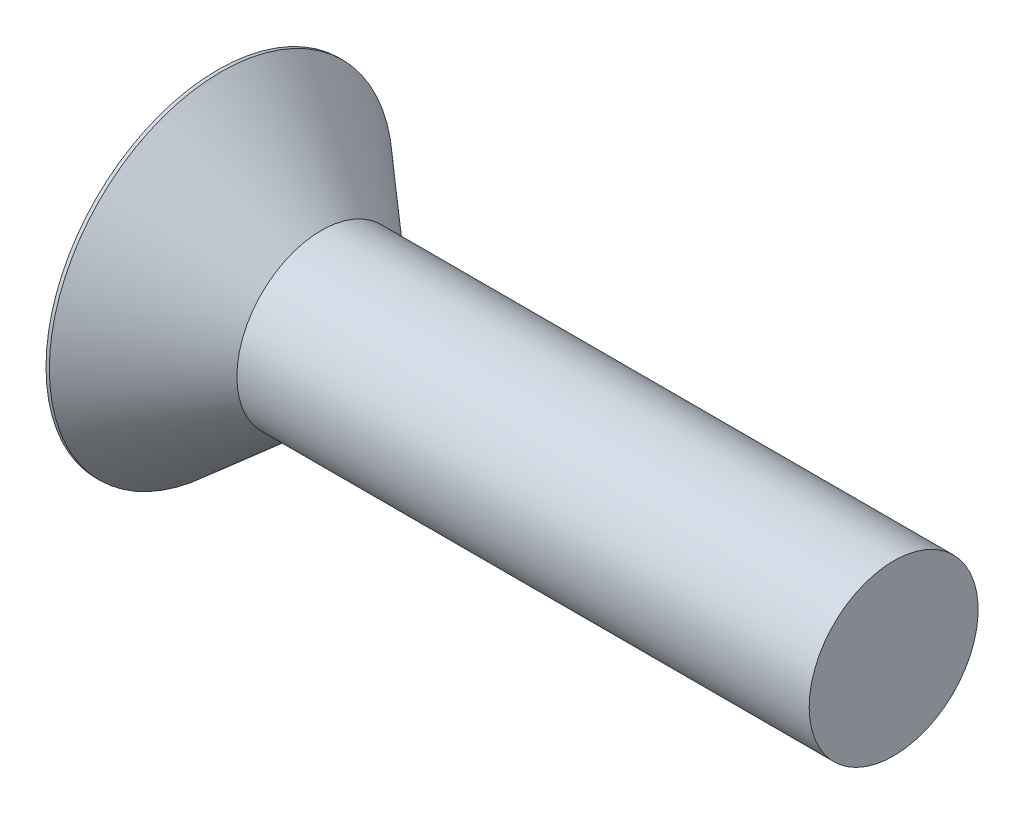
from build123d import *

# Parameters (mm, degrees)
CIRPATTERN1_COUNT = 2
CIRPATTERN1_ANGLE = 90


with BuildPart() as part:
    # BodySke → Base-Revolve (revolve)
    with BuildSketch(Plane.XY, mode=Mode.PRIVATE) as base_revolve_sk:
        Polygon((0, 0), (0, 9.6774), (0.188054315, 9.6774), (5.842, 4.7625), (38.1, 4.7625), (38.1, 0), align=None)
    revolve(base_revolve_sk.sketch.rotate(Axis((-6.35, 0, 0), (1, 0, 0)), 90), axis=Axis((-6.35, 0, 0), (1, 0, 0)))

    # Sketch3 → Cross section 0
    with BuildSketch(Plane.ZY):
        with BuildLine():
            Line((-1.0922, 6.6421), (1.0922, 6.6421))
            Line((1.0922, 6.6421), (1.0922, -6.6421))
            Line((1.0922, -6.6421), (-1.0922, -6.6421))
            Line((-1.0922, -6.6421), (-1.0922, 6.6421))
        make_face()
    # Sketch4 → Cross section 1
    with BuildSketch(Plane.ZY.offset(-7.9756)):
        with BuildLine():
            Line((-0.5461, 0.5461), (0.5461, 0.5461))
            Line((0.5461, 0.5461), (0.5461, -0.5461))
            Line((0.5461, -0.5461), (-0.5461, -0.5461))
            Line((-0.5461, -0.5461), (-0.5461, 0.5461))
        make_face()
    cross = loft(mode=Mode.SUBTRACT)

    # CirPattern1: Cross ×2 about axis
    cirpattern1_axis = Axis((0, 0, 0), (1, 0, 0))
    for i in range(1, CIRPATTERN1_COUNT):
        add(cross.rotate(cirpattern1_axis, i * CIRPATTERN1_ANGLE / (CIRPATTERN1_COUNT - 1)), mode=Mode.SUBTRACT)


solid = part.part
